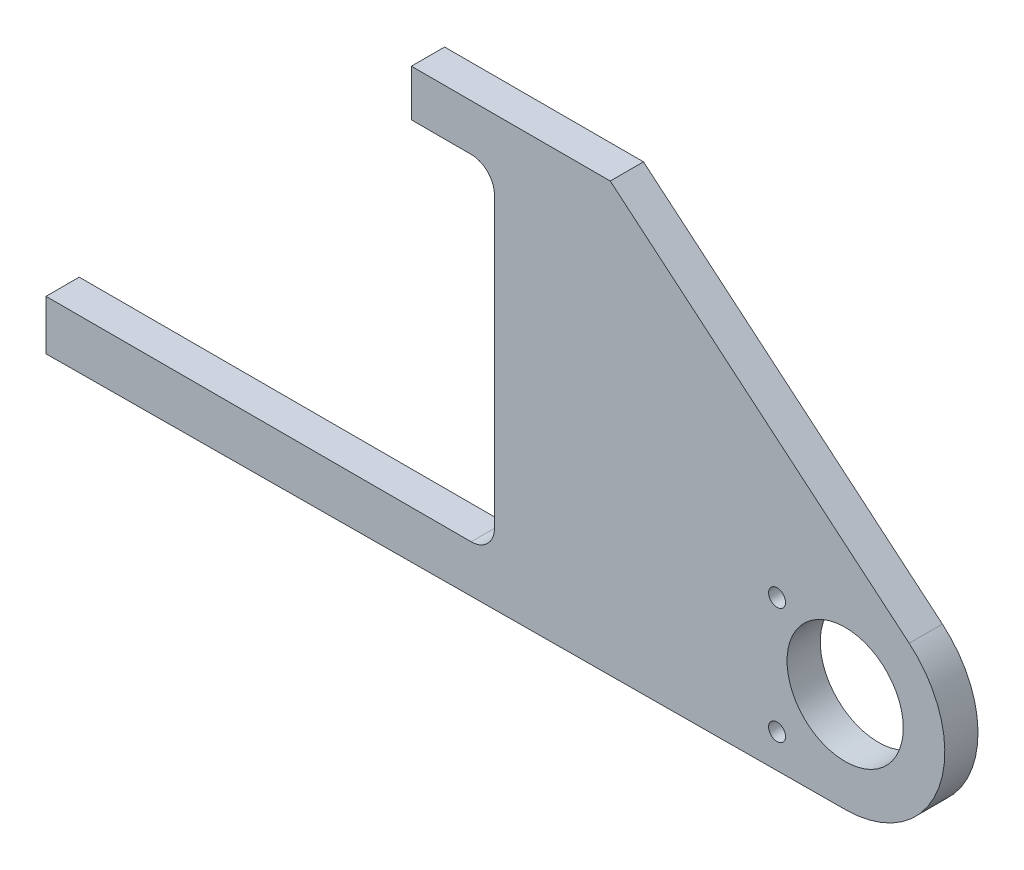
ISO-10303-21;
HEADER;
FILE_DESCRIPTION(('STEP AP214'),'2;1');
FILE_NAME('part.step','',(''),(''),'','','');
FILE_SCHEMA(('AUTOMOTIVE_DESIGN { 1 0 10303 214 1 1 1 1 }'));
ENDSEC;
DATA;
#1=APPLICATION_CONTEXT('core data for automotive mechanical design processes');
#2=APPLICATION_PROTOCOL_DEFINITION('international standard','automotive_design',2000,#1);
#3=PRODUCT_CONTEXT('',#1,'mechanical');
#4=PRODUCT('Part','Part','',(#3));
#5=PRODUCT_RELATED_PRODUCT_CATEGORY('part','',(#4));
#6=PRODUCT_DEFINITION_FORMATION('','',#4);
#7=PRODUCT_DEFINITION_CONTEXT('part definition',#1,'design');
#8=PRODUCT_DEFINITION('design','',#6,#7);
#9=PRODUCT_DEFINITION_SHAPE('','',#8);
#10=(LENGTH_UNIT() NAMED_UNIT(*) SI_UNIT(.MILLI.,.METRE.));
#11=(NAMED_UNIT(*) PLANE_ANGLE_UNIT() SI_UNIT($,.RADIAN.));
#12=(NAMED_UNIT(*) SI_UNIT($,.STERADIAN.) SOLID_ANGLE_UNIT());
#13=UNCERTAINTY_MEASURE_WITH_UNIT(LENGTH_MEASURE(1.E-05),#10,'distance_accuracy_value','');
#14=(GEOMETRIC_REPRESENTATION_CONTEXT(3) GLOBAL_UNCERTAINTY_ASSIGNED_CONTEXT((#13)) GLOBAL_UNIT_ASSIGNED_CONTEXT((#10,
#11,#12)) REPRESENTATION_CONTEXT('',''));
#15=CARTESIAN_POINT('',(0.,0.,0.));
#16=DIRECTION('',(0.,0.,1.));
#17=DIRECTION('',(1.,0.,0.));
#18=AXIS2_PLACEMENT_3D('',#15,#16,#17);
#19=CARTESIAN_POINT('',(0.,0.,20.));
#20=DIRECTION('',(0.,0.,-1.));
#21=DIRECTION('',(-1.,0.,0.));
#22=AXIS2_PLACEMENT_3D('',#19,#20,#21);
#23=PLANE('',#22);
#24=CARTESIAN_POINT('',(-41.,30.,20.));
#25=DIRECTION('',(0.,0.,1.));
#26=DIRECTION('',(1.,0.,0.));
#27=AXIS2_PLACEMENT_3D('',#24,#25,#26);
#28=CIRCLE('',#27,5.09999999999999);
#29=CARTESIAN_POINT('',(-35.9,30.,20.));
#30=VERTEX_POINT('',#29);
#31=EDGE_CURVE('E201',#30,#30,#28,.T.);
#32=ORIENTED_EDGE('',*,*,#31,.F.);
#33=EDGE_LOOP('',(#32));
#34=FACE_BOUND('',#33,.T.);
#35=CARTESIAN_POINT('',(-41.,-40.,20.));
#36=DIRECTION('',(0.,0.,1.));
#37=DIRECTION('',(1.,0.,0.));
#38=AXIS2_PLACEMENT_3D('',#35,#36,#37);
#39=CIRCLE('',#38,5.09999999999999);
#40=CARTESIAN_POINT('',(-35.9,-40.,20.));
#41=VERTEX_POINT('',#40);
#42=EDGE_CURVE('E191',#41,#41,#39,.T.);
#43=ORIENTED_EDGE('',*,*,#42,.F.);
#44=EDGE_LOOP('',(#43));
#45=FACE_BOUND('',#44,.T.);
#46=DIRECTION('',(0.,-1.,0.));
#47=VECTOR('',#46,1.);
#48=CARTESIAN_POINT('',(-481.18,-33.,20.));
#49=LINE('',#48,#47);
#50=CARTESIAN_POINT('',(-481.18,-33.,20.));
#51=VERTEX_POINT('',#50);
#52=CARTESIAN_POINT('',(-481.18,-63.,20.));
#53=VERTEX_POINT('',#52);
#54=EDGE_CURVE('E168',#51,#53,#49,.T.);
#55=ORIENTED_EDGE('',*,*,#54,.T.);
#56=DIRECTION('',(0.99998058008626,0.00623213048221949,0.));
#57=VECTOR('',#56,1.);
#58=CARTESIAN_POINT('',(0.373927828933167,-59.9988348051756,20.));
#59=LINE('',#58,#57);
#60=CARTESIAN_POINT('',(0.373927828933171,-59.9988348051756,20.));
#61=VERTEX_POINT('',#60);
#62=EDGE_CURVE('E101',#53,#61,#59,.T.);
#63=ORIENTED_EDGE('',*,*,#62,.T.);
#64=CARTESIAN_POINT('',(0.,0.,20.));
#65=DIRECTION('',(0.,0.,1.));
#66=DIRECTION('',(-1.,0.,0.));
#67=AXIS2_PLACEMENT_3D('',#64,#65,#66);
#68=CIRCLE('',#67,60.);
#69=CARTESIAN_POINT('',(38.5672565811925,45.9626665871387,20.));
#70=VERTEX_POINT('',#69);
#71=EDGE_CURVE('E208',#61,#70,#68,.T.);
#72=ORIENTED_EDGE('',*,*,#71,.T.);
#73=DIRECTION('',(-0.766044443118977,0.64278760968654,0.));
#74=VECTOR('',#73,1.);
#75=CARTESIAN_POINT('',(-141.432028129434,197.,20.));
#76=LINE('',#75,#74);
#77=CARTESIAN_POINT('',(-141.432028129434,197.,20.));
#78=VERTEX_POINT('',#77);
#79=EDGE_CURVE('E210',#70,#78,#76,.T.);
#80=ORIENTED_EDGE('',*,*,#79,.T.);
#81=DIRECTION('',(-1.,0.,0.));
#82=VECTOR('',#81,1.);
#83=CARTESIAN_POINT('',(-261.18,197.,20.));
#84=LINE('',#83,#82);
#85=CARTESIAN_POINT('',(-261.18,197.,20.));
#86=VERTEX_POINT('',#85);
#87=EDGE_CURVE('E212',#78,#86,#84,.T.);
#88=ORIENTED_EDGE('',*,*,#87,.T.);
#89=DIRECTION('',(0.,-1.,0.));
#90=VECTOR('',#89,1.);
#91=CARTESIAN_POINT('',(-261.18,169.,20.));
#92=LINE('',#91,#90);
#93=CARTESIAN_POINT('',(-261.18,169.,20.));
#94=VERTEX_POINT('',#93);
#95=EDGE_CURVE('E214',#86,#94,#92,.T.);
#96=ORIENTED_EDGE('',*,*,#95,.T.);
#97=DIRECTION('',(1.,0.,0.));
#98=VECTOR('',#97,1.);
#99=CARTESIAN_POINT('',(-225.18,169.,20.));
#100=LINE('',#99,#98);
#101=CARTESIAN_POINT('',(-225.18,169.,20.));
#102=VERTEX_POINT('',#101);
#103=EDGE_CURVE('E216',#94,#102,#100,.T.);
#104=ORIENTED_EDGE('',*,*,#103,.T.);
#105=CARTESIAN_POINT('',(-225.18,155.,20.));
#106=DIRECTION('',(0.,0.,-1.));
#107=DIRECTION('',(1.,0.,0.));
#108=AXIS2_PLACEMENT_3D('',#105,#106,#107);
#109=CIRCLE('',#108,14.);
#110=CARTESIAN_POINT('',(-211.18,155.,20.));
#111=VERTEX_POINT('',#110);
#112=EDGE_CURVE('E129',#102,#111,#109,.T.);
#113=ORIENTED_EDGE('',*,*,#112,.T.);
#114=DIRECTION('',(0.,-1.,0.));
#115=VECTOR('',#114,1.);
#116=CARTESIAN_POINT('',(-211.18,-19.,20.));
#117=LINE('',#116,#115);
#118=CARTESIAN_POINT('',(-211.18,-19.,20.));
#119=VERTEX_POINT('',#118);
#120=EDGE_CURVE('E123',#111,#119,#117,.T.);
#121=ORIENTED_EDGE('',*,*,#120,.T.);
#122=CARTESIAN_POINT('',(-225.18,-19.,20.));
#123=DIRECTION('',(0.,0.,-1.));
#124=DIRECTION('',(1.,0.,0.));
#125=AXIS2_PLACEMENT_3D('',#122,#123,#124);
#126=CIRCLE('',#125,14.);
#127=CARTESIAN_POINT('',(-225.18,-33.,20.));
#128=VERTEX_POINT('',#127);
#129=EDGE_CURVE('E127',#119,#128,#126,.T.);
#130=ORIENTED_EDGE('',*,*,#129,.T.);
#131=DIRECTION('',(-1.,0.,0.));
#132=VECTOR('',#131,1.);
#133=CARTESIAN_POINT('',(-481.18,-33.,20.));
#134=LINE('',#133,#132);
#135=EDGE_CURVE('E49',#128,#51,#134,.T.);
#136=ORIENTED_EDGE('',*,*,#135,.T.);
#137=EDGE_LOOP('',(#55,#63,#72,#80,#88,#96,#104,#113,#121,#130,#136));
#138=FACE_BOUND('',#137,.T.);
#139=CARTESIAN_POINT('',(0.,0.,20.));
#140=DIRECTION('',(0.,0.,1.));
#141=DIRECTION('',(1.,0.,0.));
#142=AXIS2_PLACEMENT_3D('',#139,#140,#141);
#143=CIRCLE('',#142,35.);
#144=CARTESIAN_POINT('',(35.,0.,20.));
#145=VERTEX_POINT('',#144);
#146=EDGE_CURVE('E151',#145,#145,#143,.T.);
#147=ORIENTED_EDGE('',*,*,#146,.F.);
#148=EDGE_LOOP('',(#147));
#149=FACE_BOUND('',#148,.T.);
#150=ADVANCED_FACE('F30',(#34,#45,#138,#149),#23,.F.);
#151=CARTESIAN_POINT('',(0.,0.,0.));
#152=DIRECTION('',(0.,0.,-1.));
#153=DIRECTION('',(-1.,0.,0.));
#154=AXIS2_PLACEMENT_3D('',#151,#152,#153);
#155=PLANE('',#154);
#156=CARTESIAN_POINT('',(-41.,30.,0.));
#157=DIRECTION('',(0.,0.,-1.));
#158=DIRECTION('',(-1.,0.,0.));
#159=AXIS2_PLACEMENT_3D('',#156,#157,#158);
#160=CIRCLE('',#159,5.09999999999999);
#161=CARTESIAN_POINT('',(-46.1,30.,0.));
#162=VERTEX_POINT('',#161);
#163=EDGE_CURVE('E34',#162,#162,#160,.T.);
#164=ORIENTED_EDGE('',*,*,#163,.F.);
#165=EDGE_LOOP('',(#164));
#166=FACE_BOUND('',#165,.T.);
#167=CARTESIAN_POINT('',(-41.,-40.,0.));
#168=DIRECTION('',(0.,0.,-1.));
#169=DIRECTION('',(-1.,0.,0.));
#170=AXIS2_PLACEMENT_3D('',#167,#168,#169);
#171=CIRCLE('',#170,5.09999999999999);
#172=CARTESIAN_POINT('',(-46.1,-40.,0.));
#173=VERTEX_POINT('',#172);
#174=EDGE_CURVE('E188',#173,#173,#171,.T.);
#175=ORIENTED_EDGE('',*,*,#174,.F.);
#176=EDGE_LOOP('',(#175));
#177=FACE_BOUND('',#176,.T.);
#178=DIRECTION('',(0.,-1.,0.));
#179=VECTOR('',#178,1.);
#180=CARTESIAN_POINT('',(-481.18,-33.,0.));
#181=LINE('',#180,#179);
#182=CARTESIAN_POINT('',(-481.18,-33.,0.));
#183=VERTEX_POINT('',#182);
#184=CARTESIAN_POINT('',(-481.18,-63.,0.));
#185=VERTEX_POINT('',#184);
#186=EDGE_CURVE('E147',#183,#185,#181,.T.);
#187=ORIENTED_EDGE('',*,*,#186,.F.);
#188=DIRECTION('',(-1.,0.,0.));
#189=VECTOR('',#188,1.);
#190=CARTESIAN_POINT('',(-481.18,-33.,0.));
#191=LINE('',#190,#189);
#192=CARTESIAN_POINT('',(-225.18,-33.,0.));
#193=VERTEX_POINT('',#192);
#194=EDGE_CURVE('E93',#193,#183,#191,.T.);
#195=ORIENTED_EDGE('',*,*,#194,.F.);
#196=CARTESIAN_POINT('',(-225.18,-19.,0.));
#197=DIRECTION('',(0.,0.,-1.));
#198=DIRECTION('',(1.,0.,0.));
#199=AXIS2_PLACEMENT_3D('',#196,#197,#198);
#200=CIRCLE('',#199,14.);
#201=CARTESIAN_POINT('',(-211.18,-19.,0.));
#202=VERTEX_POINT('',#201);
#203=EDGE_CURVE('E87',#202,#193,#200,.T.);
#204=ORIENTED_EDGE('',*,*,#203,.F.);
#205=DIRECTION('',(0.,-1.,0.));
#206=VECTOR('',#205,1.);
#207=CARTESIAN_POINT('',(-211.18,-19.,0.));
#208=LINE('',#207,#206);
#209=CARTESIAN_POINT('',(-211.18,155.,0.));
#210=VERTEX_POINT('',#209);
#211=EDGE_CURVE('E137',#210,#202,#208,.T.);
#212=ORIENTED_EDGE('',*,*,#211,.F.);
#213=CARTESIAN_POINT('',(-225.18,155.,0.));
#214=DIRECTION('',(0.,0.,-1.));
#215=DIRECTION('',(1.,0.,0.));
#216=AXIS2_PLACEMENT_3D('',#213,#214,#215);
#217=CIRCLE('',#216,14.);
#218=CARTESIAN_POINT('',(-225.18,169.,0.));
#219=VERTEX_POINT('',#218);
#220=EDGE_CURVE('E163',#219,#210,#217,.T.);
#221=ORIENTED_EDGE('',*,*,#220,.F.);
#222=DIRECTION('',(1.,0.,0.));
#223=VECTOR('',#222,1.);
#224=CARTESIAN_POINT('',(-225.18,169.,0.));
#225=LINE('',#224,#223);
#226=CARTESIAN_POINT('',(-261.18,169.,0.));
#227=VERTEX_POINT('',#226);
#228=EDGE_CURVE('E161',#227,#219,#225,.T.);
#229=ORIENTED_EDGE('',*,*,#228,.F.);
#230=DIRECTION('',(0.,-1.,0.));
#231=VECTOR('',#230,1.);
#232=CARTESIAN_POINT('',(-261.18,169.,0.));
#233=LINE('',#232,#231);
#234=CARTESIAN_POINT('',(-261.18,197.,0.));
#235=VERTEX_POINT('',#234);
#236=EDGE_CURVE('E159',#235,#227,#233,.T.);
#237=ORIENTED_EDGE('',*,*,#236,.F.);
#238=DIRECTION('',(-1.,0.,0.));
#239=VECTOR('',#238,1.);
#240=CARTESIAN_POINT('',(-261.18,197.,0.));
#241=LINE('',#240,#239);
#242=CARTESIAN_POINT('',(-141.432028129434,197.,0.));
#243=VERTEX_POINT('',#242);
#244=EDGE_CURVE('E157',#243,#235,#241,.T.);
#245=ORIENTED_EDGE('',*,*,#244,.F.);
#246=DIRECTION('',(-0.766044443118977,0.64278760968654,0.));
#247=VECTOR('',#246,1.);
#248=CARTESIAN_POINT('',(-141.432028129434,197.,0.));
#249=LINE('',#248,#247);
#250=CARTESIAN_POINT('',(38.5672565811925,45.9626665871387,0.));
#251=VERTEX_POINT('',#250);
#252=EDGE_CURVE('E155',#251,#243,#249,.T.);
#253=ORIENTED_EDGE('',*,*,#252,.F.);
#254=CARTESIAN_POINT('',(0.,0.,0.));
#255=DIRECTION('',(0.,0.,1.));
#256=DIRECTION('',(-1.,0.,0.));
#257=AXIS2_PLACEMENT_3D('',#254,#255,#256);
#258=CIRCLE('',#257,60.);
#259=CARTESIAN_POINT('',(0.373927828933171,-59.9988348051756,0.));
#260=VERTEX_POINT('',#259);
#261=EDGE_CURVE('E153',#260,#251,#258,.T.);
#262=ORIENTED_EDGE('',*,*,#261,.F.);
#263=DIRECTION('',(0.99998058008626,0.00623213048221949,0.));
#264=VECTOR('',#263,1.);
#265=CARTESIAN_POINT('',(0.373927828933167,-59.9988348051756,0.));
#266=LINE('',#265,#264);
#267=EDGE_CURVE('E150',#185,#260,#266,.T.);
#268=ORIENTED_EDGE('',*,*,#267,.F.);
#269=EDGE_LOOP('',(#187,#195,#204,#212,#221,#229,#237,#245,#253,#262,#268));
#270=FACE_BOUND('',#269,.T.);
#271=CARTESIAN_POINT('',(0.,0.,0.));
#272=DIRECTION('',(0.,0.,1.));
#273=DIRECTION('',(1.,0.,0.));
#274=AXIS2_PLACEMENT_3D('',#271,#272,#273);
#275=CIRCLE('',#274,35.);
#276=CARTESIAN_POINT('',(35.,0.,0.));
#277=VERTEX_POINT('',#276);
#278=EDGE_CURVE('E190',#277,#277,#275,.T.);
#279=ORIENTED_EDGE('',*,*,#278,.T.);
#280=EDGE_LOOP('',(#279));
#281=FACE_BOUND('',#280,.T.);
#282=ADVANCED_FACE('F229',(#166,#177,#270,#281),#155,.T.);
#283=CARTESIAN_POINT('',(-481.18,-33.,20.));
#284=DIRECTION('',(1.,0.,0.));
#285=DIRECTION('',(0.,0.,-1.));
#286=AXIS2_PLACEMENT_3D('',#283,#284,#285);
#287=PLANE('',#286);
#288=ORIENTED_EDGE('',*,*,#186,.T.);
#289=DIRECTION('',(0.,0.,-1.));
#290=VECTOR('',#289,1.);
#291=CARTESIAN_POINT('',(-481.18,-63.,20.));
#292=LINE('',#291,#290);
#293=EDGE_CURVE('E11',#53,#185,#292,.T.);
#294=ORIENTED_EDGE('',*,*,#293,.F.);
#295=ORIENTED_EDGE('',*,*,#54,.F.);
#296=DIRECTION('',(0.,0.,-1.));
#297=VECTOR('',#296,1.);
#298=CARTESIAN_POINT('',(-481.18,-33.,20.));
#299=LINE('',#298,#297);
#300=EDGE_CURVE('E143',#51,#183,#299,.T.);
#301=ORIENTED_EDGE('',*,*,#300,.T.);
#302=EDGE_LOOP('',(#288,#294,#295,#301));
#303=FACE_BOUND('',#302,.T.);
#304=ADVANCED_FACE('F32',(#303),#287,.F.);
#305=CARTESIAN_POINT('',(0.373927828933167,-59.9988348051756,20.));
#306=DIRECTION('',(-0.00623213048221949,0.99998058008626,0.));
#307=DIRECTION('',(-0.99998058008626,-0.00623213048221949,0.));
#308=AXIS2_PLACEMENT_3D('',#305,#306,#307);
#309=PLANE('',#308);
#310=ORIENTED_EDGE('',*,*,#267,.T.);
#311=DIRECTION('',(0.,0.,-1.));
#312=VECTOR('',#311,1.);
#313=CARTESIAN_POINT('',(0.373927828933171,-59.9988348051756,20.));
#314=LINE('',#313,#312);
#315=EDGE_CURVE('E40',#61,#260,#314,.T.);
#316=ORIENTED_EDGE('',*,*,#315,.F.);
#317=ORIENTED_EDGE('',*,*,#62,.F.);
#318=ORIENTED_EDGE('',*,*,#293,.T.);
#319=EDGE_LOOP('',(#310,#316,#317,#318));
#320=FACE_BOUND('',#319,.T.);
#321=ADVANCED_FACE('F299',(#320),#309,.F.);
#322=CARTESIAN_POINT('',(0.,0.,20.));
#323=DIRECTION('',(0.,0.,-1.));
#324=DIRECTION('',(-1.,0.,0.));
#325=AXIS2_PLACEMENT_3D('',#322,#323,#324);
#326=CYLINDRICAL_SURFACE('',#325,60.);
#327=ORIENTED_EDGE('',*,*,#261,.T.);
#328=DIRECTION('',(0.,0.,-1.));
#329=VECTOR('',#328,1.);
#330=CARTESIAN_POINT('',(38.5672565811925,45.9626665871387,20.));
#331=LINE('',#330,#329);
#332=EDGE_CURVE('E184',#70,#251,#331,.T.);
#333=ORIENTED_EDGE('',*,*,#332,.F.);
#334=ORIENTED_EDGE('',*,*,#71,.F.);
#335=ORIENTED_EDGE('',*,*,#315,.T.);
#336=EDGE_LOOP('',(#327,#333,#334,#335));
#337=FACE_BOUND('',#336,.T.);
#338=ADVANCED_FACE('F304',(#337),#326,.T.);
#339=CARTESIAN_POINT('',(-141.432028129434,197.,20.));
#340=DIRECTION('',(-0.64278760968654,-0.766044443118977,0.));
#341=DIRECTION('',(0.766044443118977,-0.64278760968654,0.));
#342=AXIS2_PLACEMENT_3D('',#339,#340,#341);
#343=PLANE('',#342);
#344=ORIENTED_EDGE('',*,*,#252,.T.);
#345=DIRECTION('',(0.,0.,-1.));
#346=VECTOR('',#345,1.);
#347=CARTESIAN_POINT('',(-141.432028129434,197.,20.));
#348=LINE('',#347,#346);
#349=EDGE_CURVE('E181',#78,#243,#348,.T.);
#350=ORIENTED_EDGE('',*,*,#349,.F.);
#351=ORIENTED_EDGE('',*,*,#79,.F.);
#352=ORIENTED_EDGE('',*,*,#332,.T.);
#353=EDGE_LOOP('',(#344,#350,#351,#352));
#354=FACE_BOUND('',#353,.T.);
#355=ADVANCED_FACE('F310',(#354),#343,.F.);
#356=CARTESIAN_POINT('',(-261.18,197.,20.));
#357=DIRECTION('',(0.,-1.,0.));
#358=DIRECTION('',(0.,0.,-1.));
#359=AXIS2_PLACEMENT_3D('',#356,#357,#358);
#360=PLANE('',#359);
#361=ORIENTED_EDGE('',*,*,#244,.T.);
#362=DIRECTION('',(0.,0.,-1.));
#363=VECTOR('',#362,1.);
#364=CARTESIAN_POINT('',(-261.18,197.,20.));
#365=LINE('',#364,#363);
#366=EDGE_CURVE('E178',#86,#235,#365,.T.);
#367=ORIENTED_EDGE('',*,*,#366,.F.);
#368=ORIENTED_EDGE('',*,*,#87,.F.);
#369=ORIENTED_EDGE('',*,*,#349,.T.);
#370=EDGE_LOOP('',(#361,#367,#368,#369));
#371=FACE_BOUND('',#370,.T.);
#372=ADVANCED_FACE('F318',(#371),#360,.F.);
#373=CARTESIAN_POINT('',(-261.18,169.,20.));
#374=DIRECTION('',(1.,0.,0.));
#375=DIRECTION('',(0.,0.,-1.));
#376=AXIS2_PLACEMENT_3D('',#373,#374,#375);
#377=PLANE('',#376);
#378=ORIENTED_EDGE('',*,*,#236,.T.);
#379=DIRECTION('',(0.,0.,-1.));
#380=VECTOR('',#379,1.);
#381=CARTESIAN_POINT('',(-261.18,169.,20.));
#382=LINE('',#381,#380);
#383=EDGE_CURVE('E175',#94,#227,#382,.T.);
#384=ORIENTED_EDGE('',*,*,#383,.F.);
#385=ORIENTED_EDGE('',*,*,#95,.F.);
#386=ORIENTED_EDGE('',*,*,#366,.T.);
#387=EDGE_LOOP('',(#378,#384,#385,#386));
#388=FACE_BOUND('',#387,.T.);
#389=ADVANCED_FACE('F326',(#388),#377,.F.);
#390=CARTESIAN_POINT('',(-225.18,169.,20.));
#391=DIRECTION('',(0.,1.,0.));
#392=DIRECTION('',(0.,0.,1.));
#393=AXIS2_PLACEMENT_3D('',#390,#391,#392);
#394=PLANE('',#393);
#395=ORIENTED_EDGE('',*,*,#228,.T.);
#396=DIRECTION('',(0.,0.,-1.));
#397=VECTOR('',#396,1.);
#398=CARTESIAN_POINT('',(-225.18,169.,20.));
#399=LINE('',#398,#397);
#400=EDGE_CURVE('E172',#102,#219,#399,.T.);
#401=ORIENTED_EDGE('',*,*,#400,.F.);
#402=ORIENTED_EDGE('',*,*,#103,.F.);
#403=ORIENTED_EDGE('',*,*,#383,.T.);
#404=EDGE_LOOP('',(#395,#401,#402,#403));
#405=FACE_BOUND('',#404,.T.);
#406=ADVANCED_FACE('F222',(#405),#394,.F.);
#407=CARTESIAN_POINT('',(-225.18,155.,20.));
#408=DIRECTION('',(0.,0.,-1.));
#409=DIRECTION('',(-1.,0.,0.));
#410=AXIS2_PLACEMENT_3D('',#407,#408,#409);
#411=CYLINDRICAL_SURFACE('',#410,14.);
#412=ORIENTED_EDGE('',*,*,#220,.T.);
#413=DIRECTION('',(0.,0.,-1.));
#414=VECTOR('',#413,1.);
#415=CARTESIAN_POINT('',(-211.18,155.,20.));
#416=LINE('',#415,#414);
#417=EDGE_CURVE('E138',#111,#210,#416,.T.);
#418=ORIENTED_EDGE('',*,*,#417,.F.);
#419=ORIENTED_EDGE('',*,*,#112,.F.);
#420=ORIENTED_EDGE('',*,*,#400,.T.);
#421=EDGE_LOOP('',(#412,#418,#419,#420));
#422=FACE_BOUND('',#421,.T.);
#423=ADVANCED_FACE('F226',(#422),#411,.F.);
#424=CARTESIAN_POINT('',(-211.18,-19.,20.));
#425=DIRECTION('',(1.,0.,0.));
#426=DIRECTION('',(0.,0.,-1.));
#427=AXIS2_PLACEMENT_3D('',#424,#425,#426);
#428=PLANE('',#427);
#429=ORIENTED_EDGE('',*,*,#211,.T.);
#430=DIRECTION('',(0.,0.,-1.));
#431=VECTOR('',#430,1.);
#432=CARTESIAN_POINT('',(-211.18,-19.,20.));
#433=LINE('',#432,#431);
#434=EDGE_CURVE('E134',#119,#202,#433,.T.);
#435=ORIENTED_EDGE('',*,*,#434,.F.);
#436=ORIENTED_EDGE('',*,*,#120,.F.);
#437=ORIENTED_EDGE('',*,*,#417,.T.);
#438=EDGE_LOOP('',(#429,#435,#436,#437));
#439=FACE_BOUND('',#438,.T.);
#440=ADVANCED_FACE('F135',(#439),#428,.F.);
#441=CARTESIAN_POINT('',(-225.18,-19.,20.));
#442=DIRECTION('',(0.,0.,-1.));
#443=DIRECTION('',(-1.,0.,0.));
#444=AXIS2_PLACEMENT_3D('',#441,#442,#443);
#445=CYLINDRICAL_SURFACE('',#444,14.);
#446=ORIENTED_EDGE('',*,*,#203,.T.);
#447=DIRECTION('',(0.,0.,-1.));
#448=VECTOR('',#447,1.);
#449=CARTESIAN_POINT('',(-225.18,-33.,20.));
#450=LINE('',#449,#448);
#451=EDGE_CURVE('E139',#128,#193,#450,.T.);
#452=ORIENTED_EDGE('',*,*,#451,.F.);
#453=ORIENTED_EDGE('',*,*,#129,.F.);
#454=ORIENTED_EDGE('',*,*,#434,.T.);
#455=EDGE_LOOP('',(#446,#452,#453,#454));
#456=FACE_BOUND('',#455,.T.);
#457=ADVANCED_FACE('F141',(#456),#445,.F.);
#458=CARTESIAN_POINT('',(-481.18,-33.,20.));
#459=DIRECTION('',(0.,-1.,0.));
#460=DIRECTION('',(1.,0.,0.));
#461=AXIS2_PLACEMENT_3D('',#458,#459,#460);
#462=PLANE('',#461);
#463=ORIENTED_EDGE('',*,*,#194,.T.);
#464=ORIENTED_EDGE('',*,*,#300,.F.);
#465=ORIENTED_EDGE('',*,*,#135,.F.);
#466=ORIENTED_EDGE('',*,*,#451,.T.);
#467=EDGE_LOOP('',(#463,#464,#465,#466));
#468=FACE_BOUND('',#467,.T.);
#469=ADVANCED_FACE('F235',(#468),#462,.F.);
#470=CARTESIAN_POINT('',(0.,0.,20.));
#471=DIRECTION('',(0.,0.,-1.));
#472=DIRECTION('',(-1.,0.,0.));
#473=AXIS2_PLACEMENT_3D('',#470,#471,#472);
#474=CYLINDRICAL_SURFACE('',#473,35.);
#475=ORIENTED_EDGE('',*,*,#146,.T.);
#476=EDGE_LOOP('',(#475));
#477=FACE_BOUND('',#476,.T.);
#478=ORIENTED_EDGE('',*,*,#278,.F.);
#479=EDGE_LOOP('',(#478));
#480=FACE_BOUND('',#479,.T.);
#481=ADVANCED_FACE('F237',(#477,#480),#474,.F.);
#482=CARTESIAN_POINT('',(-41.,-40.,20.));
#483=DIRECTION('',(0.,0.,1.));
#484=DIRECTION('',(1.,0.,0.));
#485=AXIS2_PLACEMENT_3D('',#482,#483,#484);
#486=CYLINDRICAL_SURFACE('',#485,5.09999999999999);
#487=ORIENTED_EDGE('',*,*,#174,.T.);
#488=EDGE_LOOP('',(#487));
#489=FACE_BOUND('',#488,.T.);
#490=ORIENTED_EDGE('',*,*,#42,.T.);
#491=EDGE_LOOP('',(#490));
#492=FACE_BOUND('',#491,.T.);
#493=ADVANCED_FACE('F243',(#489,#492),#486,.F.);
#494=CARTESIAN_POINT('',(-41.,30.,20.));
#495=DIRECTION('',(0.,0.,1.));
#496=DIRECTION('',(1.,0.,0.));
#497=AXIS2_PLACEMENT_3D('',#494,#495,#496);
#498=CYLINDRICAL_SURFACE('',#497,5.09999999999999);
#499=ORIENTED_EDGE('',*,*,#163,.T.);
#500=EDGE_LOOP('',(#499));
#501=FACE_BOUND('',#500,.T.);
#502=ORIENTED_EDGE('',*,*,#31,.T.);
#503=EDGE_LOOP('',(#502));
#504=FACE_BOUND('',#503,.T.);
#505=ADVANCED_FACE('F260',(#501,#504),#498,.F.);
#506=CLOSED_SHELL('',(#150,#282,#304,#321,#338,#355,#372,#389,#406,#423,#440,#457,#469,#481,
#493,#505));
#507=MANIFOLD_SOLID_BREP('B2',#506);
#508=ADVANCED_BREP_SHAPE_REPRESENTATION('',(#18,#507),#14);
#509=SHAPE_DEFINITION_REPRESENTATION(#9,#508);
ENDSEC;
END-ISO-10303-21;
